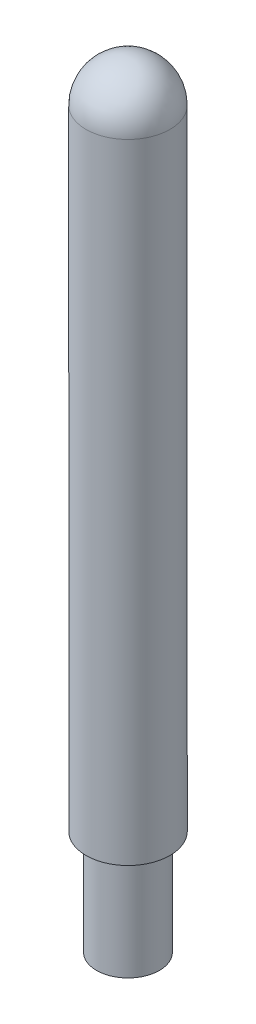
ISO-10303-21;
HEADER;
FILE_DESCRIPTION(('STEP AP214'),'2;1');
FILE_NAME('part.step','',(''),(''),'','','');
FILE_SCHEMA(('AUTOMOTIVE_DESIGN { 1 0 10303 214 1 1 1 1 }'));
ENDSEC;
DATA;
#1=APPLICATION_CONTEXT('core data for automotive mechanical design processes');
#2=APPLICATION_PROTOCOL_DEFINITION('international standard','automotive_design',2000,#1);
#3=PRODUCT_CONTEXT('',#1,'mechanical');
#4=PRODUCT('Part','Part','',(#3));
#5=PRODUCT_RELATED_PRODUCT_CATEGORY('part','',(#4));
#6=PRODUCT_DEFINITION_FORMATION('','',#4);
#7=PRODUCT_DEFINITION_CONTEXT('part definition',#1,'design');
#8=PRODUCT_DEFINITION('design','',#6,#7);
#9=PRODUCT_DEFINITION_SHAPE('','',#8);
#10=(LENGTH_UNIT() NAMED_UNIT(*) SI_UNIT(.MILLI.,.METRE.));
#11=(NAMED_UNIT(*) PLANE_ANGLE_UNIT() SI_UNIT($,.RADIAN.));
#12=(NAMED_UNIT(*) SI_UNIT($,.STERADIAN.) SOLID_ANGLE_UNIT());
#13=UNCERTAINTY_MEASURE_WITH_UNIT(LENGTH_MEASURE(1.E-05),#10,'distance_accuracy_value','');
#14=(GEOMETRIC_REPRESENTATION_CONTEXT(3) GLOBAL_UNCERTAINTY_ASSIGNED_CONTEXT((#13)) GLOBAL_UNIT_ASSIGNED_CONTEXT((#10,
#11,#12)) REPRESENTATION_CONTEXT('',''));
#15=CARTESIAN_POINT('',(0.,0.,0.));
#16=DIRECTION('',(0.,0.,1.));
#17=DIRECTION('',(1.,0.,0.));
#18=AXIS2_PLACEMENT_3D('',#15,#16,#17);
#19=CARTESIAN_POINT('',(0.,10.,0.));
#20=DIRECTION('',(0.,-1.,0.));
#21=DIRECTION('',(0.,0.,-1.));
#22=AXIS2_PLACEMENT_3D('',#19,#20,#21);
#23=CYLINDRICAL_SURFACE('',#22,3.);
#24=CARTESIAN_POINT('',(0.,10.,0.));
#25=DIRECTION('',(0.,1.,0.));
#26=DIRECTION('',(0.,0.,1.));
#27=AXIS2_PLACEMENT_3D('',#24,#25,#26);
#28=CIRCLE('',#27,3.);
#29=CARTESIAN_POINT('',(0.,10.,3.));
#30=VERTEX_POINT('',#29);
#31=EDGE_CURVE('E10',#30,#30,#28,.T.);
#32=ORIENTED_EDGE('',*,*,#31,.F.);
#33=EDGE_LOOP('',(#32));
#34=FACE_BOUND('',#33,.T.);
#35=CARTESIAN_POINT('',(0.,0.,0.));
#36=DIRECTION('',(0.,1.,0.));
#37=DIRECTION('',(0.,0.,1.));
#38=AXIS2_PLACEMENT_3D('',#35,#36,#37);
#39=CIRCLE('',#38,3.);
#40=CARTESIAN_POINT('',(0.,0.,3.));
#41=VERTEX_POINT('',#40);
#42=EDGE_CURVE('E34',#41,#41,#39,.T.);
#43=ORIENTED_EDGE('',*,*,#42,.T.);
#44=EDGE_LOOP('',(#43));
#45=FACE_BOUND('',#44,.T.);
#46=ADVANCED_FACE('F31',(#34,#45),#23,.T.);
#47=CARTESIAN_POINT('',(0.,0.,0.));
#48=DIRECTION('',(0.,1.,0.));
#49=DIRECTION('',(0.,0.,1.));
#50=AXIS2_PLACEMENT_3D('',#47,#48,#49);
#51=PLANE('',#50);
#52=ORIENTED_EDGE('',*,*,#42,.F.);
#53=EDGE_LOOP('',(#52));
#54=FACE_BOUND('',#53,.T.);
#55=ADVANCED_FACE('F59',(#54),#51,.F.);
#56=CARTESIAN_POINT('',(0.,10.,0.));
#57=DIRECTION('',(0.,1.,0.));
#58=DIRECTION('',(0.,0.,1.));
#59=AXIS2_PLACEMENT_3D('',#56,#57,#58);
#60=PLANE('',#59);
#61=CARTESIAN_POINT('',(0.,10.,0.));
#62=DIRECTION('',(0.,1.,0.));
#63=DIRECTION('',(0.,0.,1.));
#64=AXIS2_PLACEMENT_3D('',#61,#62,#63);
#65=CIRCLE('',#64,4.);
#66=CARTESIAN_POINT('',(0.,10.,4.));
#67=VERTEX_POINT('',#66);
#68=EDGE_CURVE('E43',#67,#67,#65,.T.);
#69=ORIENTED_EDGE('',*,*,#68,.F.);
#70=EDGE_LOOP('',(#69));
#71=FACE_BOUND('',#70,.T.);
#72=ORIENTED_EDGE('',*,*,#31,.T.);
#73=EDGE_LOOP('',(#72));
#74=FACE_BOUND('',#73,.T.);
#75=ADVANCED_FACE('F54',(#71,#74),#60,.F.);
#76=CARTESIAN_POINT('',(0.,70.,0.));
#77=DIRECTION('',(0.,-1.,0.));
#78=DIRECTION('',(0.,0.,-1.));
#79=AXIS2_PLACEMENT_3D('',#76,#77,#78);
#80=CYLINDRICAL_SURFACE('',#79,4.);
#81=CARTESIAN_POINT('',(0.,70.,0.));
#82=DIRECTION('',(0.,1.,0.));
#83=DIRECTION('',(0.,0.,1.));
#84=AXIS2_PLACEMENT_3D('',#81,#82,#83);
#85=CIRCLE('',#84,4.);
#86=CARTESIAN_POINT('',(0.,70.,4.));
#87=VERTEX_POINT('',#86);
#88=EDGE_CURVE('E41',#87,#87,#85,.T.);
#89=ORIENTED_EDGE('',*,*,#88,.F.);
#90=EDGE_LOOP('',(#89));
#91=FACE_BOUND('',#90,.T.);
#92=ORIENTED_EDGE('',*,*,#68,.T.);
#93=EDGE_LOOP('',(#92));
#94=FACE_BOUND('',#93,.T.);
#95=ADVANCED_FACE('F51',(#91,#94),#80,.T.);
#96=CARTESIAN_POINT('',(0.,70.,0.));
#97=DIRECTION('',(0.,1.,0.));
#98=DIRECTION('',(1.,0.,0.));
#99=AXIS2_PLACEMENT_3D('',#96,#97,#98);
#100=SPHERICAL_SURFACE('',#99,4.);
#101=ORIENTED_EDGE('',*,*,#88,.T.);
#102=EDGE_LOOP('',(#101));
#103=FACE_BOUND('',#102,.T.);
#104=ADVANCED_FACE('F49',(#103),#100,.T.);
#105=CLOSED_SHELL('',(#46,#55,#75,#95,#104));
#106=MANIFOLD_SOLID_BREP('B2',#105);
#107=ADVANCED_BREP_SHAPE_REPRESENTATION('',(#18,#106),#14);
#108=SHAPE_DEFINITION_REPRESENTATION(#9,#107);
ENDSEC;
END-ISO-10303-21;
